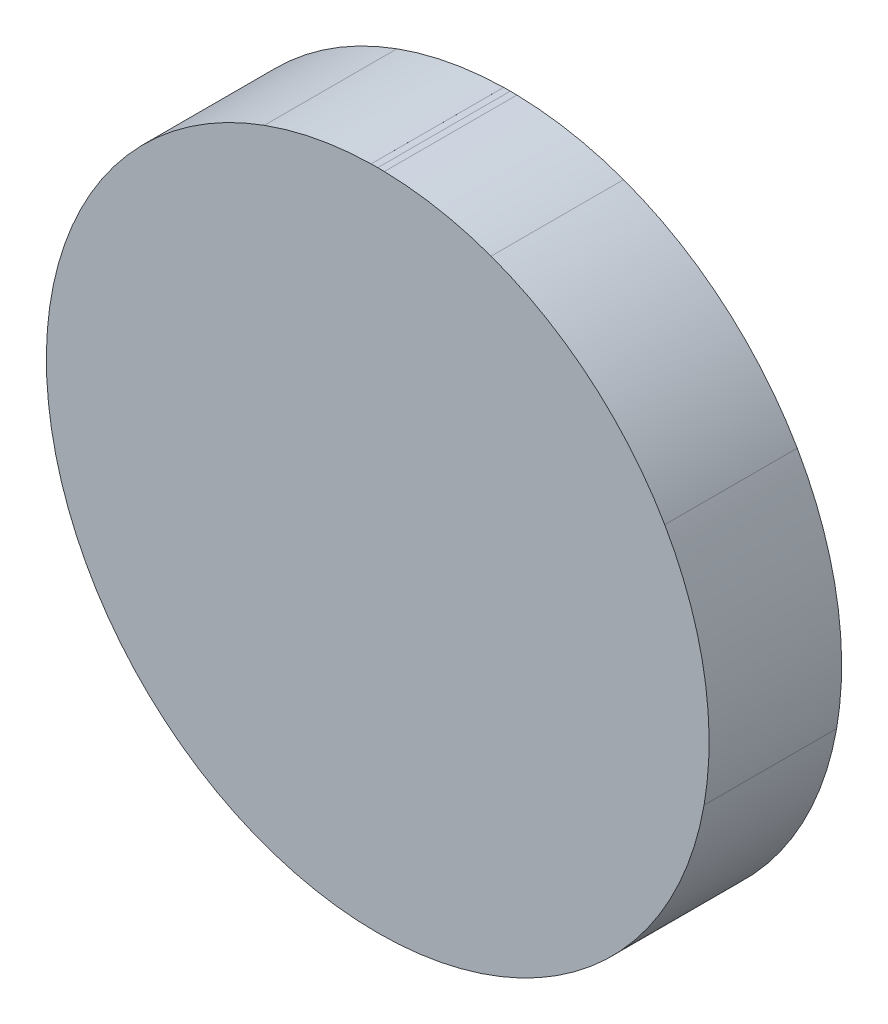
ISO-10303-21;
HEADER;
FILE_DESCRIPTION(('STEP AP214'),'2;1');
FILE_NAME('part.step','',(''),(''),'','','');
FILE_SCHEMA(('AUTOMOTIVE_DESIGN { 1 0 10303 214 1 1 1 1 }'));
ENDSEC;
DATA;
#1=APPLICATION_CONTEXT('core data for automotive mechanical design processes');
#2=APPLICATION_PROTOCOL_DEFINITION('international standard','automotive_design',2000,#1);
#3=PRODUCT_CONTEXT('',#1,'mechanical');
#4=PRODUCT('Part','Part','',(#3));
#5=PRODUCT_RELATED_PRODUCT_CATEGORY('part','',(#4));
#6=PRODUCT_DEFINITION_FORMATION('','',#4);
#7=PRODUCT_DEFINITION_CONTEXT('part definition',#1,'design');
#8=PRODUCT_DEFINITION('design','',#6,#7);
#9=PRODUCT_DEFINITION_SHAPE('','',#8);
#10=(LENGTH_UNIT() NAMED_UNIT(*) SI_UNIT(.MILLI.,.METRE.));
#11=(NAMED_UNIT(*) PLANE_ANGLE_UNIT() SI_UNIT($,.RADIAN.));
#12=(NAMED_UNIT(*) SI_UNIT($,.STERADIAN.) SOLID_ANGLE_UNIT());
#13=UNCERTAINTY_MEASURE_WITH_UNIT(LENGTH_MEASURE(1.E-05),#10,'distance_accuracy_value','');
#14=(GEOMETRIC_REPRESENTATION_CONTEXT(3) GLOBAL_UNCERTAINTY_ASSIGNED_CONTEXT((#13)) GLOBAL_UNIT_ASSIGNED_CONTEXT((#10,
#11,#12)) REPRESENTATION_CONTEXT('',''));
#15=CARTESIAN_POINT('',(0.,0.,0.));
#16=DIRECTION('',(0.,0.,1.));
#17=DIRECTION('',(1.,0.,0.));
#18=AXIS2_PLACEMENT_3D('',#15,#16,#17);
#19=CARTESIAN_POINT('',(0.,0.,10.));
#20=DIRECTION('',(0.,0.,-1.));
#21=DIRECTION('',(-1.,0.,0.));
#22=AXIS2_PLACEMENT_3D('',#19,#20,#21);
#23=CYLINDRICAL_SURFACE('',#22,25.);
#24=DIRECTION('',(0.,0.,-1.));
#25=VECTOR('',#24,1.);
#26=CARTESIAN_POINT('',(-8.55144824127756,23.4919716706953,5.));
#27=LINE('',#26,#25);
#28=CARTESIAN_POINT('',(-8.55144824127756,23.4919716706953,10.));
#29=VERTEX_POINT('',#28);
#30=CARTESIAN_POINT('',(-8.55144824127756,23.4919716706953,0.));
#31=VERTEX_POINT('',#30);
#32=EDGE_CURVE('E58',#29,#31,#27,.T.);
#33=ORIENTED_EDGE('',*,*,#32,.F.);
#34=CARTESIAN_POINT('',(0.,0.,10.));
#35=DIRECTION('',(0.,0.,1.));
#36=DIRECTION('',(1.,0.,0.));
#37=AXIS2_PLACEMENT_3D('',#34,#35,#36);
#38=CIRCLE('',#37,25.);
#39=CARTESIAN_POINT('',(-0.499974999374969,24.995,10.));
#40=VERTEX_POINT('',#39);
#41=EDGE_CURVE('E266',#40,#29,#38,.T.);
#42=ORIENTED_EDGE('',*,*,#41,.F.);
#43=DIRECTION('',(0.,0.,-1.));
#44=VECTOR('',#43,1.);
#45=CARTESIAN_POINT('',(-0.499974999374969,24.995,5.));
#46=LINE('',#45,#44);
#47=CARTESIAN_POINT('',(-0.499974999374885,24.995,0.));
#48=VERTEX_POINT('',#47);
#49=EDGE_CURVE('E251',#48,#40,#46,.F.);
#50=ORIENTED_EDGE('',*,*,#49,.F.);
#51=CARTESIAN_POINT('',(0.,0.,0.));
#52=DIRECTION('',(0.,0.,1.));
#53=DIRECTION('',(1.,0.,0.));
#54=AXIS2_PLACEMENT_3D('',#51,#52,#53);
#55=CIRCLE('',#54,25.);
#56=EDGE_CURVE('E270',#48,#31,#55,.T.);
#57=ORIENTED_EDGE('',*,*,#56,.T.);
#58=EDGE_LOOP('',(#33,#42,#50,#57));
#59=FACE_BOUND('',#58,.T.);
#60=ADVANCED_FACE('F43',(#59),#23,.T.);
#61=DIRECTION('',(0.,0.,-1.));
#62=VECTOR('',#61,1.);
#63=CARTESIAN_POINT('',(8.55144824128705,23.4919716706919,5.));
#64=LINE('',#63,#62);
#65=CARTESIAN_POINT('',(8.55144824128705,23.4919716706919,0.));
#66=VERTEX_POINT('',#65);
#67=CARTESIAN_POINT('',(8.55144824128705,23.4919716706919,10.));
#68=VERTEX_POINT('',#67);
#69=EDGE_CURVE('E66',#66,#68,#64,.F.);
#70=ORIENTED_EDGE('',*,*,#69,.F.);
#71=CARTESIAN_POINT('',(0.499974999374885,24.995,0.));
#72=VERTEX_POINT('',#71);
#73=EDGE_CURVE('E170',#66,#72,#55,.T.);
#74=ORIENTED_EDGE('',*,*,#73,.T.);
#75=DIRECTION('',(0.,0.,-1.));
#76=VECTOR('',#75,1.);
#77=CARTESIAN_POINT('',(0.499974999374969,24.995,5.));
#78=LINE('',#77,#76);
#79=CARTESIAN_POINT('',(0.499974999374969,24.995,10.));
#80=VERTEX_POINT('',#79);
#81=EDGE_CURVE('E254',#80,#72,#78,.T.);
#82=ORIENTED_EDGE('',*,*,#81,.F.);
#83=EDGE_CURVE('E269',#68,#80,#38,.T.);
#84=ORIENTED_EDGE('',*,*,#83,.F.);
#85=EDGE_LOOP('',(#70,#74,#82,#84));
#86=FACE_BOUND('',#85,.T.);
#87=ADVANCED_FACE('F330',(#86),#23,.T.);
#88=CARTESIAN_POINT('',(0.,25.,-0.000999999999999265));
#89=DIRECTION('',(0.,0.,1.));
#90=DIRECTION('',(1.,0.,0.));
#91=AXIS2_PLACEMENT_3D('',#88,#89,#90);
#92=CYLINDRICAL_SURFACE('',#91,0.500000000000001);
#93=DIRECTION('',(0.,0.,-1.));
#94=VECTOR('',#93,1.);
#95=CARTESIAN_POINT('',(-0.499968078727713,24.9943501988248,5.));
#96=LINE('',#95,#94);
#97=CARTESIAN_POINT('',(-0.499968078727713,24.9943501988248,0.));
#98=VERTEX_POINT('',#97);
#99=CARTESIAN_POINT('',(-0.499968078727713,24.9943501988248,10.));
#100=VERTEX_POINT('',#99);
#101=EDGE_CURVE('E11',#98,#100,#96,.F.);
#102=ORIENTED_EDGE('',*,*,#101,.F.);
#103=CARTESIAN_POINT('',(0.,25.,0.));
#104=DIRECTION('',(0.,0.,1.));
#105=DIRECTION('',(1.,0.,0.));
#106=AXIS2_PLACEMENT_3D('',#103,#104,#105);
#107=CIRCLE('',#106,0.500000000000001);
#108=EDGE_CURVE('E262',#98,#48,#107,.F.);
#109=ORIENTED_EDGE('',*,*,#108,.T.);
#110=ORIENTED_EDGE('',*,*,#49,.T.);
#111=CARTESIAN_POINT('',(0.,25.,10.));
#112=DIRECTION('',(0.,0.,1.));
#113=DIRECTION('',(1.,0.,0.));
#114=AXIS2_PLACEMENT_3D('',#111,#112,#113);
#115=CIRCLE('',#114,0.500000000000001);
#116=EDGE_CURVE('E259',#40,#100,#115,.T.);
#117=ORIENTED_EDGE('',*,*,#116,.T.);
#118=EDGE_LOOP('',(#102,#109,#110,#117));
#119=FACE_BOUND('',#118,.T.);
#120=ADVANCED_FACE('F327',(#119),#92,.F.);
#121=DIRECTION('',(0.,0.,-1.));
#122=VECTOR('',#121,1.);
#123=CARTESIAN_POINT('',(0.499968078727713,24.9943501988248,5.));
#124=LINE('',#123,#122);
#125=CARTESIAN_POINT('',(0.499968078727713,24.9943501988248,10.));
#126=VERTEX_POINT('',#125);
#127=CARTESIAN_POINT('',(0.499968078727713,24.9943501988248,0.));
#128=VERTEX_POINT('',#127);
#129=EDGE_CURVE('E51',#126,#128,#124,.T.);
#130=ORIENTED_EDGE('',*,*,#129,.F.);
#131=EDGE_CURVE('E258',#126,#80,#115,.T.);
#132=ORIENTED_EDGE('',*,*,#131,.T.);
#133=ORIENTED_EDGE('',*,*,#81,.T.);
#134=EDGE_CURVE('E263',#72,#128,#107,.F.);
#135=ORIENTED_EDGE('',*,*,#134,.T.);
#136=EDGE_LOOP('',(#130,#132,#133,#135));
#137=FACE_BOUND('',#136,.T.);
#138=ADVANCED_FACE('F331',(#137),#92,.F.);
#139=CARTESIAN_POINT('',(0.,0.,10.));
#140=DIRECTION('',(0.,0.,1.));
#141=DIRECTION('',(1.,0.,0.));
#142=AXIS2_PLACEMENT_3D('',#139,#140,#141);
#143=PLANE('',#142);
#144=ORIENTED_EDGE('',*,*,#131,.F.);
#145=CARTESIAN_POINT('',(0.00188933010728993,-0.000687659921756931,10.));
#146=DIRECTION('',(0.,0.,1.));
#147=DIRECTION('',(0.766044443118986,-0.64278760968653,0.));
#148=AXIS2_PLACEMENT_3D('',#145,#146,#147);
#149=CIRCLE('',#148,25.);
#150=CARTESIAN_POINT('',(4.96783913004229E-12,24.9993122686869,10.));
#151=VERTEX_POINT('',#150);
#152=EDGE_CURVE('E172',#126,#151,#149,.T.);
#153=ORIENTED_EDGE('',*,*,#152,.T.);
#154=CARTESIAN_POINT('',(-0.00188933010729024,-0.00068765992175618,10.));
#155=DIRECTION('',(0.,0.,1.));
#156=DIRECTION('',(0.766044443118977,0.642787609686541,0.));
#157=AXIS2_PLACEMENT_3D('',#154,#155,#156);
#158=CIRCLE('',#157,25.);
#159=EDGE_CURVE('E238',#151,#100,#158,.T.);
#160=ORIENTED_EDGE('',*,*,#159,.T.);
#161=ORIENTED_EDGE('',*,*,#116,.F.);
#162=ORIENTED_EDGE('',*,*,#41,.T.);
#163=CARTESIAN_POINT('',(-21.6530270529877,12.4984417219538,10.));
#164=VERTEX_POINT('',#163);
#165=EDGE_CURVE('E242',#29,#164,#158,.T.);
#166=ORIENTED_EDGE('',*,*,#165,.T.);
#167=CARTESIAN_POINT('',(-0.00289462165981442,-0.00242887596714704,10.));
#168=DIRECTION('',(0.,0.,1.));
#169=DIRECTION('',(0.173648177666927,0.984807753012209,0.));
#170=AXIS2_PLACEMENT_3D('',#167,#168,#169);
#171=CIRCLE('',#170,25.);
#172=CARTESIAN_POINT('',(-24.6229138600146,-4.34462333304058,10.));
#173=VERTEX_POINT('',#172);
#174=EDGE_CURVE('E224',#164,#173,#171,.T.);
#175=ORIENTED_EDGE('',*,*,#174,.T.);
#176=CARTESIAN_POINT('',(-0.00254548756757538,-0.00440891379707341,10.));
#177=DIRECTION('',(0.,0.,1.));
#178=DIRECTION('',(-0.500000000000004,0.866025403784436,0.));
#179=AXIS2_PLACEMENT_3D('',#176,#177,#178);
#180=CIRCLE('',#179,25.);
#181=CARTESIAN_POINT('',(-16.0714656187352,-19.1561661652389,10.));
#182=VERTEX_POINT('',#181);
#183=EDGE_CURVE('E214',#173,#182,#180,.T.);
#184=ORIENTED_EDGE('',*,*,#183,.T.);
#185=CARTESIAN_POINT('',(-0.00100529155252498,-0.00570129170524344,10.));
#186=DIRECTION('',(0.,0.,1.));
#187=DIRECTION('',(-0.939692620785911,0.342020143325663,0.));
#188=AXIS2_PLACEMENT_3D('',#185,#186,#187);
#189=CIRCLE('',#188,25.);
#190=CARTESIAN_POINT('',(-4.97234195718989E-12,-25.005701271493,10.));
#191=VERTEX_POINT('',#190);
#192=EDGE_CURVE('E204',#182,#191,#189,.T.);
#193=ORIENTED_EDGE('',*,*,#192,.T.);
#194=CARTESIAN_POINT('',(0.00100529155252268,-0.00570129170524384,10.));
#195=DIRECTION('',(0.,0.,1.));
#196=DIRECTION('',(-0.939692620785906,-0.342020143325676,0.));
#197=AXIS2_PLACEMENT_3D('',#194,#195,#196);
#198=CIRCLE('',#197,25.);
#199=CARTESIAN_POINT('',(16.0714656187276,-19.1561661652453,10.));
#200=VERTEX_POINT('',#199);
#201=EDGE_CURVE('E194',#191,#200,#198,.T.);
#202=ORIENTED_EDGE('',*,*,#201,.T.);
#203=CARTESIAN_POINT('',(0.00254548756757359,-0.00440891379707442,10.));
#204=DIRECTION('',(0.,0.,1.));
#205=DIRECTION('',(-0.499999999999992,-0.866025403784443,0.));
#206=AXIS2_PLACEMENT_3D('',#203,#204,#205);
#207=CIRCLE('',#206,25.);
#208=CARTESIAN_POINT('',(24.6229138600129,-4.34462333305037,10.));
#209=VERTEX_POINT('',#208);
#210=EDGE_CURVE('E184',#200,#209,#207,.T.);
#211=ORIENTED_EDGE('',*,*,#210,.T.);
#212=CARTESIAN_POINT('',(0.00289462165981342,-0.00242887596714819,10.));
#213=DIRECTION('',(0.,0.,1.));
#214=DIRECTION('',(0.17364817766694,-0.984807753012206,0.));
#215=AXIS2_PLACEMENT_3D('',#212,#213,#214);
#216=CIRCLE('',#215,25.);
#217=CARTESIAN_POINT('',(21.6530270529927,12.4984417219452,10.));
#218=VERTEX_POINT('',#217);
#219=EDGE_CURVE('E158',#209,#218,#216,.T.);
#220=ORIENTED_EDGE('',*,*,#219,.T.);
#221=EDGE_CURVE('E165',#218,#68,#149,.T.);
#222=ORIENTED_EDGE('',*,*,#221,.T.);
#223=ORIENTED_EDGE('',*,*,#83,.T.);
#224=EDGE_LOOP('',(#144,#153,#160,#161,#162,#166,#175,#184,#193,#202,#211,#220,#222,#223));
#225=FACE_BOUND('',#224,.T.);
#226=ADVANCED_FACE('F290',(#225),#143,.T.);
#227=CARTESIAN_POINT('',(0.,0.,0.));
#228=DIRECTION('',(0.,0.,1.));
#229=DIRECTION('',(1.,0.,0.));
#230=AXIS2_PLACEMENT_3D('',#227,#228,#229);
#231=PLANE('',#230);
#232=ORIENTED_EDGE('',*,*,#73,.F.);
#233=CARTESIAN_POINT('',(0.00188933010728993,-0.000687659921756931,0.));
#234=DIRECTION('',(0.,0.,1.));
#235=DIRECTION('',(0.766044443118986,-0.64278760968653,0.));
#236=AXIS2_PLACEMENT_3D('',#233,#234,#235);
#237=CIRCLE('',#236,25.);
#238=CARTESIAN_POINT('',(21.6530270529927,12.4984417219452,0.));
#239=VERTEX_POINT('',#238);
#240=EDGE_CURVE('E163',#239,#66,#237,.T.);
#241=ORIENTED_EDGE('',*,*,#240,.F.);
#242=CARTESIAN_POINT('',(0.00289462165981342,-0.00242887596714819,0.));
#243=DIRECTION('',(0.,0.,1.));
#244=DIRECTION('',(0.17364817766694,-0.984807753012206,0.));
#245=AXIS2_PLACEMENT_3D('',#242,#243,#244);
#246=CIRCLE('',#245,25.);
#247=CARTESIAN_POINT('',(24.6229138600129,-4.34462333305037,0.));
#248=VERTEX_POINT('',#247);
#249=EDGE_CURVE('E146',#248,#239,#246,.T.);
#250=ORIENTED_EDGE('',*,*,#249,.F.);
#251=CARTESIAN_POINT('',(0.00254548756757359,-0.00440891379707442,0.));
#252=DIRECTION('',(0.,0.,1.));
#253=DIRECTION('',(-0.499999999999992,-0.866025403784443,0.));
#254=AXIS2_PLACEMENT_3D('',#251,#252,#253);
#255=CIRCLE('',#254,25.);
#256=CARTESIAN_POINT('',(16.0714656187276,-19.1561661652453,0.));
#257=VERTEX_POINT('',#256);
#258=EDGE_CURVE('E183',#257,#248,#255,.T.);
#259=ORIENTED_EDGE('',*,*,#258,.F.);
#260=CARTESIAN_POINT('',(0.00100529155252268,-0.00570129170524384,0.));
#261=DIRECTION('',(0.,0.,1.));
#262=DIRECTION('',(-0.939692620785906,-0.342020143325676,0.));
#263=AXIS2_PLACEMENT_3D('',#260,#261,#262);
#264=CIRCLE('',#263,25.);
#265=CARTESIAN_POINT('',(-4.97234195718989E-12,-25.005701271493,0.));
#266=VERTEX_POINT('',#265);
#267=EDGE_CURVE('E193',#266,#257,#264,.T.);
#268=ORIENTED_EDGE('',*,*,#267,.F.);
#269=CARTESIAN_POINT('',(-0.00100529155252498,-0.00570129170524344,0.));
#270=DIRECTION('',(0.,0.,1.));
#271=DIRECTION('',(-0.939692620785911,0.342020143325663,0.));
#272=AXIS2_PLACEMENT_3D('',#269,#270,#271);
#273=CIRCLE('',#272,25.);
#274=CARTESIAN_POINT('',(-16.0714656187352,-19.1561661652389,0.));
#275=VERTEX_POINT('',#274);
#276=EDGE_CURVE('E203',#275,#266,#273,.T.);
#277=ORIENTED_EDGE('',*,*,#276,.F.);
#278=CARTESIAN_POINT('',(-0.00254548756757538,-0.00440891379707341,0.));
#279=DIRECTION('',(0.,0.,1.));
#280=DIRECTION('',(-0.500000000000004,0.866025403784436,0.));
#281=AXIS2_PLACEMENT_3D('',#278,#279,#280);
#282=CIRCLE('',#281,25.);
#283=CARTESIAN_POINT('',(-24.6229138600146,-4.34462333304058,0.));
#284=VERTEX_POINT('',#283);
#285=EDGE_CURVE('E213',#284,#275,#282,.T.);
#286=ORIENTED_EDGE('',*,*,#285,.F.);
#287=CARTESIAN_POINT('',(-0.00289462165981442,-0.00242887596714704,0.));
#288=DIRECTION('',(0.,0.,1.));
#289=DIRECTION('',(0.173648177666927,0.984807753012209,0.));
#290=AXIS2_PLACEMENT_3D('',#287,#288,#289);
#291=CIRCLE('',#290,25.);
#292=CARTESIAN_POINT('',(-21.6530270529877,12.4984417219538,0.));
#293=VERTEX_POINT('',#292);
#294=EDGE_CURVE('E223',#293,#284,#291,.T.);
#295=ORIENTED_EDGE('',*,*,#294,.F.);
#296=CARTESIAN_POINT('',(-0.00188933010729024,-0.00068765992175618,0.));
#297=DIRECTION('',(0.,0.,1.));
#298=DIRECTION('',(0.766044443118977,0.642787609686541,0.));
#299=AXIS2_PLACEMENT_3D('',#296,#297,#298);
#300=CIRCLE('',#299,25.);
#301=EDGE_CURVE('E237',#31,#293,#300,.T.);
#302=ORIENTED_EDGE('',*,*,#301,.F.);
#303=ORIENTED_EDGE('',*,*,#56,.F.);
#304=ORIENTED_EDGE('',*,*,#108,.F.);
#305=CARTESIAN_POINT('',(4.96783913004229E-12,24.9993122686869,0.));
#306=VERTEX_POINT('',#305);
#307=EDGE_CURVE('E243',#306,#98,#300,.T.);
#308=ORIENTED_EDGE('',*,*,#307,.F.);
#309=EDGE_CURVE('E173',#128,#306,#237,.T.);
#310=ORIENTED_EDGE('',*,*,#309,.F.);
#311=ORIENTED_EDGE('',*,*,#134,.F.);
#312=EDGE_LOOP('',(#232,#241,#250,#259,#268,#277,#286,#295,#302,#303,#304,#308,#310,#311));
#313=FACE_BOUND('',#312,.T.);
#314=ADVANCED_FACE('F168',(#313),#231,.F.);
#315=CARTESIAN_POINT('',(0.00188933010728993,-0.000687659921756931,10.));
#316=DIRECTION('',(0.,0.,-1.));
#317=DIRECTION('',(-1.,0.,0.));
#318=AXIS2_PLACEMENT_3D('',#315,#316,#317);
#319=CYLINDRICAL_SURFACE('',#318,25.);
#320=ORIENTED_EDGE('',*,*,#152,.F.);
#321=ORIENTED_EDGE('',*,*,#129,.T.);
#322=ORIENTED_EDGE('',*,*,#309,.T.);
#323=DIRECTION('',(0.,0.,-1.));
#324=VECTOR('',#323,1.);
#325=CARTESIAN_POINT('',(4.96783913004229E-12,24.9993122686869,5.));
#326=LINE('',#325,#324);
#327=EDGE_CURVE('E227',#306,#151,#326,.F.);
#328=ORIENTED_EDGE('',*,*,#327,.T.);
#329=EDGE_LOOP('',(#320,#321,#322,#328));
#330=FACE_BOUND('',#329,.T.);
#331=ADVANCED_FACE('F277',(#330),#319,.T.);
#332=CARTESIAN_POINT('',(-0.00188933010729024,-0.00068765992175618,10.));
#333=DIRECTION('',(0.,0.,-1.));
#334=DIRECTION('',(-1.,0.,0.));
#335=AXIS2_PLACEMENT_3D('',#332,#333,#334);
#336=CYLINDRICAL_SURFACE('',#335,25.);
#337=ORIENTED_EDGE('',*,*,#307,.T.);
#338=ORIENTED_EDGE('',*,*,#101,.T.);
#339=ORIENTED_EDGE('',*,*,#159,.F.);
#340=ORIENTED_EDGE('',*,*,#327,.F.);
#341=EDGE_LOOP('',(#337,#338,#339,#340));
#342=FACE_BOUND('',#341,.T.);
#343=ADVANCED_FACE('F286',(#342),#336,.T.);
#344=ORIENTED_EDGE('',*,*,#165,.F.);
#345=ORIENTED_EDGE('',*,*,#32,.T.);
#346=ORIENTED_EDGE('',*,*,#301,.T.);
#347=DIRECTION('',(0.,0.,-1.));
#348=VECTOR('',#347,1.);
#349=CARTESIAN_POINT('',(-21.6530270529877,12.4984417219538,5.));
#350=LINE('',#349,#348);
#351=EDGE_CURVE('E233',#164,#293,#350,.T.);
#352=ORIENTED_EDGE('',*,*,#351,.F.);
#353=EDGE_LOOP('',(#344,#345,#346,#352));
#354=FACE_BOUND('',#353,.T.);
#355=ADVANCED_FACE('F324',(#354),#336,.T.);
#356=ORIENTED_EDGE('',*,*,#240,.T.);
#357=ORIENTED_EDGE('',*,*,#69,.T.);
#358=ORIENTED_EDGE('',*,*,#221,.F.);
#359=DIRECTION('',(0.,0.,-1.));
#360=VECTOR('',#359,1.);
#361=CARTESIAN_POINT('',(21.6530270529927,12.4984417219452,5.));
#362=LINE('',#361,#360);
#363=EDGE_CURVE('E150',#218,#239,#362,.T.);
#364=ORIENTED_EDGE('',*,*,#363,.T.);
#365=EDGE_LOOP('',(#356,#357,#358,#364));
#366=FACE_BOUND('',#365,.T.);
#367=ADVANCED_FACE('F162',(#366),#319,.T.);
#368=CARTESIAN_POINT('',(-0.00289462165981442,-0.00242887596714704,10.));
#369=DIRECTION('',(0.,0.,-1.));
#370=DIRECTION('',(-1.,0.,0.));
#371=AXIS2_PLACEMENT_3D('',#368,#369,#370);
#372=CYLINDRICAL_SURFACE('',#371,25.);
#373=ORIENTED_EDGE('',*,*,#174,.F.);
#374=ORIENTED_EDGE('',*,*,#351,.T.);
#375=ORIENTED_EDGE('',*,*,#294,.T.);
#376=DIRECTION('',(0.,0.,-1.));
#377=VECTOR('',#376,1.);
#378=CARTESIAN_POINT('',(-24.6229138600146,-4.34462333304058,5.));
#379=LINE('',#378,#377);
#380=EDGE_CURVE('E217',#173,#284,#379,.T.);
#381=ORIENTED_EDGE('',*,*,#380,.F.);
#382=EDGE_LOOP('',(#373,#374,#375,#381));
#383=FACE_BOUND('',#382,.T.);
#384=ADVANCED_FACE('F320',(#383),#372,.T.);
#385=CARTESIAN_POINT('',(-0.00254548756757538,-0.00440891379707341,10.));
#386=DIRECTION('',(0.,0.,-1.));
#387=DIRECTION('',(-1.,0.,0.));
#388=AXIS2_PLACEMENT_3D('',#385,#386,#387);
#389=CYLINDRICAL_SURFACE('',#388,25.);
#390=ORIENTED_EDGE('',*,*,#183,.F.);
#391=ORIENTED_EDGE('',*,*,#380,.T.);
#392=ORIENTED_EDGE('',*,*,#285,.T.);
#393=DIRECTION('',(0.,0.,-1.));
#394=VECTOR('',#393,1.);
#395=CARTESIAN_POINT('',(-16.0714656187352,-19.1561661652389,5.));
#396=LINE('',#395,#394);
#397=EDGE_CURVE('E207',#182,#275,#396,.T.);
#398=ORIENTED_EDGE('',*,*,#397,.F.);
#399=EDGE_LOOP('',(#390,#391,#392,#398));
#400=FACE_BOUND('',#399,.T.);
#401=ADVANCED_FACE('F314',(#400),#389,.T.);
#402=CARTESIAN_POINT('',(-0.00100529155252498,-0.00570129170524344,10.));
#403=DIRECTION('',(0.,0.,-1.));
#404=DIRECTION('',(-1.,0.,0.));
#405=AXIS2_PLACEMENT_3D('',#402,#403,#404);
#406=CYLINDRICAL_SURFACE('',#405,25.);
#407=ORIENTED_EDGE('',*,*,#192,.F.);
#408=ORIENTED_EDGE('',*,*,#397,.T.);
#409=ORIENTED_EDGE('',*,*,#276,.T.);
#410=DIRECTION('',(0.,0.,-1.));
#411=VECTOR('',#410,1.);
#412=CARTESIAN_POINT('',(-4.97234195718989E-12,-25.005701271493,5.));
#413=LINE('',#412,#411);
#414=EDGE_CURVE('E197',#191,#266,#413,.T.);
#415=ORIENTED_EDGE('',*,*,#414,.F.);
#416=EDGE_LOOP('',(#407,#408,#409,#415));
#417=FACE_BOUND('',#416,.T.);
#418=ADVANCED_FACE('F310',(#417),#406,.T.);
#419=CARTESIAN_POINT('',(0.00100529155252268,-0.00570129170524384,10.));
#420=DIRECTION('',(0.,0.,-1.));
#421=DIRECTION('',(-1.,0.,0.));
#422=AXIS2_PLACEMENT_3D('',#419,#420,#421);
#423=CYLINDRICAL_SURFACE('',#422,25.);
#424=ORIENTED_EDGE('',*,*,#201,.F.);
#425=ORIENTED_EDGE('',*,*,#414,.T.);
#426=ORIENTED_EDGE('',*,*,#267,.T.);
#427=DIRECTION('',(0.,0.,-1.));
#428=VECTOR('',#427,1.);
#429=CARTESIAN_POINT('',(16.0714656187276,-19.1561661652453,5.));
#430=LINE('',#429,#428);
#431=EDGE_CURVE('E187',#200,#257,#430,.T.);
#432=ORIENTED_EDGE('',*,*,#431,.F.);
#433=EDGE_LOOP('',(#424,#425,#426,#432));
#434=FACE_BOUND('',#433,.T.);
#435=ADVANCED_FACE('F306',(#434),#423,.T.);
#436=CARTESIAN_POINT('',(0.00254548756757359,-0.00440891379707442,10.));
#437=DIRECTION('',(0.,0.,-1.));
#438=DIRECTION('',(-1.,0.,0.));
#439=AXIS2_PLACEMENT_3D('',#436,#437,#438);
#440=CYLINDRICAL_SURFACE('',#439,25.);
#441=ORIENTED_EDGE('',*,*,#210,.F.);
#442=ORIENTED_EDGE('',*,*,#431,.T.);
#443=ORIENTED_EDGE('',*,*,#258,.T.);
#444=DIRECTION('',(0.,0.,-1.));
#445=VECTOR('',#444,1.);
#446=CARTESIAN_POINT('',(24.6229138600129,-4.34462333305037,5.));
#447=LINE('',#446,#445);
#448=EDGE_CURVE('E153',#209,#248,#447,.T.);
#449=ORIENTED_EDGE('',*,*,#448,.F.);
#450=EDGE_LOOP('',(#441,#442,#443,#449));
#451=FACE_BOUND('',#450,.T.);
#452=ADVANCED_FACE('F301',(#451),#440,.T.);
#453=CARTESIAN_POINT('',(0.00289462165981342,-0.00242887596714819,10.));
#454=DIRECTION('',(0.,0.,-1.));
#455=DIRECTION('',(-1.,0.,0.));
#456=AXIS2_PLACEMENT_3D('',#453,#454,#455);
#457=CYLINDRICAL_SURFACE('',#456,25.);
#458=ORIENTED_EDGE('',*,*,#219,.F.);
#459=ORIENTED_EDGE('',*,*,#448,.T.);
#460=ORIENTED_EDGE('',*,*,#249,.T.);
#461=ORIENTED_EDGE('',*,*,#363,.F.);
#462=EDGE_LOOP('',(#458,#459,#460,#461));
#463=FACE_BOUND('',#462,.T.);
#464=ADVANCED_FACE('F149',(#463),#457,.T.);
#465=CLOSED_SHELL('',(#60,#87,#120,#138,#226,#314,#331,#343,#355,#367,#384,#401,#418,#435,#452,#464));
#466=MANIFOLD_SOLID_BREP('B2',#465);
#467=ADVANCED_BREP_SHAPE_REPRESENTATION('',(#18,#466),#14);
#468=SHAPE_DEFINITION_REPRESENTATION(#9,#467);
ENDSEC;
END-ISO-10303-21;
